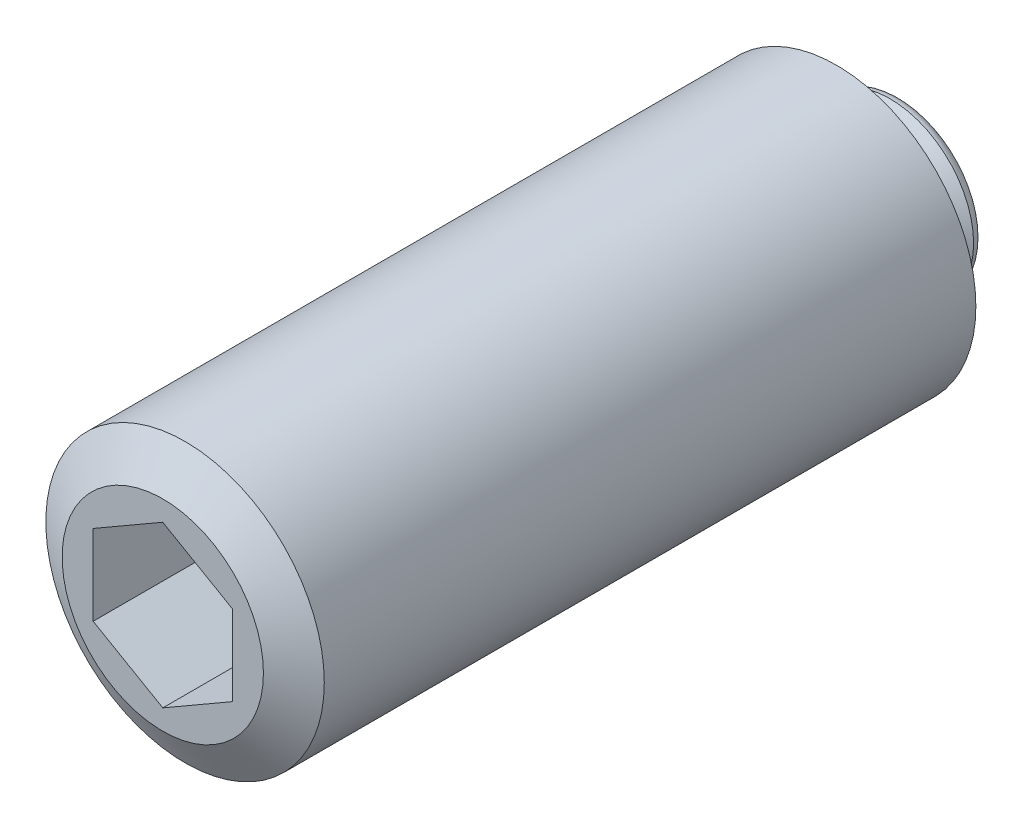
ISO-10303-21;
HEADER;
FILE_DESCRIPTION(('STEP AP214'),'2;1');
FILE_NAME('part.step','',(''),(''),'','','');
FILE_SCHEMA(('AUTOMOTIVE_DESIGN { 1 0 10303 214 1 1 1 1 }'));
ENDSEC;
DATA;
#1=APPLICATION_CONTEXT('core data for automotive mechanical design processes');
#2=APPLICATION_PROTOCOL_DEFINITION('international standard','automotive_design',2000,#1);
#3=PRODUCT_CONTEXT('',#1,'mechanical');
#4=PRODUCT('Part','Part','',(#3));
#5=PRODUCT_RELATED_PRODUCT_CATEGORY('part','',(#4));
#6=PRODUCT_DEFINITION_FORMATION('','',#4);
#7=PRODUCT_DEFINITION_CONTEXT('part definition',#1,'design');
#8=PRODUCT_DEFINITION('design','',#6,#7);
#9=PRODUCT_DEFINITION_SHAPE('','',#8);
#10=(LENGTH_UNIT() NAMED_UNIT(*) SI_UNIT(.MILLI.,.METRE.));
#11=(NAMED_UNIT(*) PLANE_ANGLE_UNIT() SI_UNIT($,.RADIAN.));
#12=(NAMED_UNIT(*) SI_UNIT($,.STERADIAN.) SOLID_ANGLE_UNIT());
#13=UNCERTAINTY_MEASURE_WITH_UNIT(LENGTH_MEASURE(1.E-05),#10,'distance_accuracy_value','');
#14=(GEOMETRIC_REPRESENTATION_CONTEXT(3) GLOBAL_UNCERTAINTY_ASSIGNED_CONTEXT((#13)) GLOBAL_UNIT_ASSIGNED_CONTEXT((#10,
#11,#12)) REPRESENTATION_CONTEXT('',''));
#15=CARTESIAN_POINT('',(0.,0.,0.));
#16=DIRECTION('',(0.,0.,1.));
#17=DIRECTION('',(1.,0.,0.));
#18=AXIS2_PLACEMENT_3D('',#15,#16,#17);
#19=CARTESIAN_POINT('',(0.,3.61435950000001,26.5));
#20=DIRECTION('',(0.,0.,1.));
#21=DIRECTION('',(1.,0.,0.));
#22=AXIS2_PLACEMENT_3D('',#19,#20,#21);
#23=PLANE('',#22);
#24=DIRECTION('',(-0.866025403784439,0.5,0.));
#25=VECTOR('',#24,1.);
#26=CARTESIAN_POINT('',(2.5,1.44337567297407,26.5));
#27=LINE('',#26,#25);
#28=CARTESIAN_POINT('',(2.5,1.44337567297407,26.5));
#29=VERTEX_POINT('',#28);
#30=CARTESIAN_POINT('',(0.,2.88675134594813,26.5));
#31=VERTEX_POINT('',#30);
#32=EDGE_CURVE('E28',#29,#31,#27,.T.);
#33=ORIENTED_EDGE('',*,*,#32,.F.);
#34=DIRECTION('',(0.,1.,0.));
#35=VECTOR('',#34,1.);
#36=CARTESIAN_POINT('',(2.5,-1.44337567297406,26.5));
#37=LINE('',#36,#35);
#38=CARTESIAN_POINT('',(2.5,-1.44337567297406,26.5));
#39=VERTEX_POINT('',#38);
#40=EDGE_CURVE('E111',#39,#29,#37,.T.);
#41=ORIENTED_EDGE('',*,*,#40,.F.);
#42=DIRECTION('',(0.866025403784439,0.5,0.));
#43=VECTOR('',#42,1.);
#44=CARTESIAN_POINT('',(0.,-2.88675134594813,26.5));
#45=LINE('',#44,#43);
#46=CARTESIAN_POINT('',(0.,-2.88675134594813,26.5));
#47=VERTEX_POINT('',#46);
#48=EDGE_CURVE('E109',#47,#39,#45,.T.);
#49=ORIENTED_EDGE('',*,*,#48,.F.);
#50=DIRECTION('',(0.866025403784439,-0.5,0.));
#51=VECTOR('',#50,1.);
#52=CARTESIAN_POINT('',(-2.5,-1.44337567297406,26.5));
#53=LINE('',#52,#51);
#54=CARTESIAN_POINT('',(-2.5,-1.44337567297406,26.5));
#55=VERTEX_POINT('',#54);
#56=EDGE_CURVE('E76',#55,#47,#53,.T.);
#57=ORIENTED_EDGE('',*,*,#56,.F.);
#58=DIRECTION('',(0.,-1.,0.));
#59=VECTOR('',#58,1.);
#60=CARTESIAN_POINT('',(-2.5,1.44337567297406,26.5));
#61=LINE('',#60,#59);
#62=CARTESIAN_POINT('',(-2.5,1.44337567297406,26.5));
#63=VERTEX_POINT('',#62);
#64=EDGE_CURVE('E105',#63,#55,#61,.T.);
#65=ORIENTED_EDGE('',*,*,#64,.F.);
#66=DIRECTION('',(-0.866025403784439,-0.5,0.));
#67=VECTOR('',#66,1.);
#68=CARTESIAN_POINT('',(0.,2.88675134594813,26.5));
#69=LINE('',#68,#67);
#70=EDGE_CURVE('E102',#31,#63,#69,.T.);
#71=ORIENTED_EDGE('',*,*,#70,.F.);
#72=EDGE_LOOP('',(#33,#41,#49,#57,#65,#71));
#73=FACE_BOUND('',#72,.T.);
#74=CARTESIAN_POINT('',(0.,0.,26.5));
#75=DIRECTION('',(0.,0.,1.));
#76=DIRECTION('',(1.,0.,0.));
#77=AXIS2_PLACEMENT_3D('',#74,#75,#76);
#78=CIRCLE('',#77,3.61435950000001);
#79=CARTESIAN_POINT('',(3.61435950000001,0.,26.5));
#80=VERTEX_POINT('',#79);
#81=EDGE_CURVE('E9',#80,#80,#78,.T.);
#82=ORIENTED_EDGE('',*,*,#81,.T.);
#83=EDGE_LOOP('',(#82));
#84=FACE_BOUND('',#83,.T.);
#85=ADVANCED_FACE('F14',(#73,#84),#23,.T.);
#86=CARTESIAN_POINT('',(0.,0.,26.5));
#87=DIRECTION('',(0.,0.,-1.));
#88=DIRECTION('',(-1.,0.,0.));
#89=AXIS2_PLACEMENT_3D('',#86,#87,#88);
#90=CONICAL_SURFACE('',#89,3.61435950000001,1.0471973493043);
#91=CARTESIAN_POINT('',(0.,0.,25.7));
#92=DIRECTION('',(0.,0.,1.));
#93=DIRECTION('',(1.,0.,0.));
#94=AXIS2_PLACEMENT_3D('',#91,#92,#93);
#95=CIRCLE('',#94,4.9999995);
#96=CARTESIAN_POINT('',(4.9999995,0.,25.7));
#97=VERTEX_POINT('',#96);
#98=EDGE_CURVE('E21',#97,#97,#95,.T.);
#99=ORIENTED_EDGE('',*,*,#98,.T.);
#100=EDGE_LOOP('',(#99));
#101=FACE_BOUND('',#100,.T.);
#102=ORIENTED_EDGE('',*,*,#81,.F.);
#103=EDGE_LOOP('',(#102));
#104=FACE_BOUND('',#103,.T.);
#105=ADVANCED_FACE('F143',(#101,#104),#90,.T.);
#106=CARTESIAN_POINT('',(0.,0.,29.5));
#107=DIRECTION('',(0.,0.,1.));
#108=DIRECTION('',(1.,0.,0.));
#109=AXIS2_PLACEMENT_3D('',#106,#107,#108);
#110=CYLINDRICAL_SURFACE('',#109,4.9999995);
#111=CARTESIAN_POINT('',(0.,0.,2.3));
#112=DIRECTION('',(0.,0.,1.));
#113=DIRECTION('',(1.,0.,0.));
#114=AXIS2_PLACEMENT_3D('',#111,#112,#113);
#115=CIRCLE('',#114,4.9999995);
#116=CARTESIAN_POINT('',(4.9999995,0.,2.3));
#117=VERTEX_POINT('',#116);
#118=EDGE_CURVE('E138',#117,#117,#115,.T.);
#119=ORIENTED_EDGE('',*,*,#118,.T.);
#120=EDGE_LOOP('',(#119));
#121=FACE_BOUND('',#120,.T.);
#122=ORIENTED_EDGE('',*,*,#98,.F.);
#123=EDGE_LOOP('',(#122));
#124=FACE_BOUND('',#123,.T.);
#125=ADVANCED_FACE('F146',(#121,#124),#110,.T.);
#126=CARTESIAN_POINT('',(0.,0.,2.3));
#127=DIRECTION('',(0.,0.,1.));
#128=DIRECTION('',(1.,0.,0.));
#129=AXIS2_PLACEMENT_3D('',#126,#127,#128);
#130=CONICAL_SURFACE('',#129,4.9999995,1.0471973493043);
#131=CARTESIAN_POINT('',(0.,0.,1.5));
#132=DIRECTION('',(0.,0.,1.));
#133=DIRECTION('',(1.,0.,0.));
#134=AXIS2_PLACEMENT_3D('',#131,#132,#133);
#135=CIRCLE('',#134,3.61435950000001);
#136=CARTESIAN_POINT('',(3.61435950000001,0.,1.5));
#137=VERTEX_POINT('',#136);
#138=EDGE_CURVE('E135',#137,#137,#135,.T.);
#139=ORIENTED_EDGE('',*,*,#138,.T.);
#140=EDGE_LOOP('',(#139));
#141=FACE_BOUND('',#140,.T.);
#142=ORIENTED_EDGE('',*,*,#118,.F.);
#143=EDGE_LOOP('',(#142));
#144=FACE_BOUND('',#143,.T.);
#145=ADVANCED_FACE('F148',(#141,#144),#130,.T.);
#146=CARTESIAN_POINT('',(0.,3.61435950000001,1.5));
#147=DIRECTION('',(0.,0.,-1.));
#148=DIRECTION('',(-1.,0.,0.));
#149=AXIS2_PLACEMENT_3D('',#146,#147,#148);
#150=PLANE('',#149);
#151=CARTESIAN_POINT('',(0.,0.,1.5));
#152=DIRECTION('',(0.,0.,1.));
#153=DIRECTION('',(1.,0.,0.));
#154=AXIS2_PLACEMENT_3D('',#151,#152,#153);
#155=CIRCLE('',#154,2.);
#156=CARTESIAN_POINT('',(2.,0.,1.5));
#157=VERTEX_POINT('',#156);
#158=EDGE_CURVE('E132',#157,#157,#155,.T.);
#159=ORIENTED_EDGE('',*,*,#158,.T.);
#160=EDGE_LOOP('',(#159));
#161=FACE_BOUND('',#160,.T.);
#162=ORIENTED_EDGE('',*,*,#138,.F.);
#163=EDGE_LOOP('',(#162));
#164=FACE_BOUND('',#163,.T.);
#165=ADVANCED_FACE('F157',(#161,#164),#150,.T.);
#166=CARTESIAN_POINT('',(0.,0.,29.5));
#167=DIRECTION('',(0.,0.,1.));
#168=DIRECTION('',(1.,0.,0.));
#169=AXIS2_PLACEMENT_3D('',#166,#167,#168);
#170=CYLINDRICAL_SURFACE('',#169,2.);
#171=CARTESIAN_POINT('',(0.,0.,1.2134315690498));
#172=DIRECTION('',(0.,0.,1.));
#173=DIRECTION('',(1.,0.,0.));
#174=AXIS2_PLACEMENT_3D('',#171,#172,#173);
#175=CIRCLE('',#174,2.);
#176=CARTESIAN_POINT('',(2.,0.,1.2134315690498));
#177=VERTEX_POINT('',#176);
#178=EDGE_CURVE('E129',#177,#177,#175,.T.);
#179=ORIENTED_EDGE('',*,*,#178,.T.);
#180=EDGE_LOOP('',(#179));
#181=FACE_BOUND('',#180,.T.);
#182=ORIENTED_EDGE('',*,*,#158,.F.);
#183=EDGE_LOOP('',(#182));
#184=FACE_BOUND('',#183,.T.);
#185=ADVANCED_FACE('F200',(#181,#184),#170,.T.);
#186=CARTESIAN_POINT('',(0.,0.,1.2134315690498));
#187=DIRECTION('',(0.,0.,1.));
#188=DIRECTION('',(1.,0.,0.));
#189=AXIS2_PLACEMENT_3D('',#186,#187,#188);
#190=TOROIDAL_SURFACE('',#189,2.254,0.254000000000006);
#191=CARTESIAN_POINT('',(0.,0.,1.0053669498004));
#192=DIRECTION('',(0.,0.,1.));
#193=DIRECTION('',(1.,0.,0.));
#194=AXIS2_PLACEMENT_3D('',#191,#192,#193);
#195=CIRCLE('',#194,2.10831158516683);
#196=CARTESIAN_POINT('',(2.10831158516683,0.,1.0053669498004));
#197=VERTEX_POINT('',#196);
#198=EDGE_CURVE('E126',#197,#197,#195,.T.);
#199=ORIENTED_EDGE('',*,*,#198,.T.);
#200=EDGE_LOOP('',(#199));
#201=FACE_BOUND('',#200,.T.);
#202=ORIENTED_EDGE('',*,*,#178,.F.);
#203=EDGE_LOOP('',(#202));
#204=FACE_BOUND('',#203,.T.);
#205=ADVANCED_FACE('F196',(#201,#204),#190,.F.);
#206=CARTESIAN_POINT('',(0.,0.,1.0053669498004));
#207=DIRECTION('',(0.,0.,-1.));
#208=DIRECTION('',(-1.,0.,0.));
#209=AXIS2_PLACEMENT_3D('',#206,#207,#208);
#210=CONICAL_SURFACE('',#209,2.10831158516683,0.959931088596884);
#211=CARTESIAN_POINT('',(0.,0.,0.381));
#212=DIRECTION('',(0.,0.,1.));
#213=DIRECTION('',(1.,0.,0.));
#214=AXIS2_PLACEMENT_3D('',#211,#212,#213);
#215=CIRCLE('',#214,3.);
#216=CARTESIAN_POINT('',(3.,0.,0.381));
#217=VERTEX_POINT('',#216);
#218=EDGE_CURVE('E123',#217,#217,#215,.T.);
#219=ORIENTED_EDGE('',*,*,#218,.T.);
#220=EDGE_LOOP('',(#219));
#221=FACE_BOUND('',#220,.T.);
#222=ORIENTED_EDGE('',*,*,#198,.F.);
#223=EDGE_LOOP('',(#222));
#224=FACE_BOUND('',#223,.T.);
#225=ADVANCED_FACE('F192',(#221,#224),#210,.T.);
#226=CARTESIAN_POINT('',(0.,0.,0.381));
#227=DIRECTION('',(0.,0.,1.));
#228=DIRECTION('',(1.,0.,0.));
#229=AXIS2_PLACEMENT_3D('',#226,#227,#228);
#230=TOROIDAL_SURFACE('',#229,2.619,0.381);
#231=CARTESIAN_POINT('',(0.,0.,0.));
#232=DIRECTION('',(0.,0.,1.));
#233=DIRECTION('',(1.,0.,0.));
#234=AXIS2_PLACEMENT_3D('',#231,#232,#233);
#235=CIRCLE('',#234,2.619);
#236=CARTESIAN_POINT('',(2.619,0.,0.));
#237=VERTEX_POINT('',#236);
#238=EDGE_CURVE('E115',#237,#237,#235,.T.);
#239=ORIENTED_EDGE('',*,*,#238,.T.);
#240=EDGE_LOOP('',(#239));
#241=FACE_BOUND('',#240,.T.);
#242=ORIENTED_EDGE('',*,*,#218,.F.);
#243=EDGE_LOOP('',(#242));
#244=FACE_BOUND('',#243,.T.);
#245=ADVANCED_FACE('F184',(#241,#244),#230,.T.);
#246=CARTESIAN_POINT('',(0.,0.,0.));
#247=DIRECTION('',(0.,0.,-1.));
#248=DIRECTION('',(-1.,0.,0.));
#249=AXIS2_PLACEMENT_3D('',#246,#247,#248);
#250=PLANE('',#249);
#251=ORIENTED_EDGE('',*,*,#238,.F.);
#252=EDGE_LOOP('',(#251));
#253=FACE_BOUND('',#252,.T.);
#254=ADVANCED_FACE('F176',(#253),#250,.T.);
#255=CARTESIAN_POINT('',(2.5,1.44337567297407,22.5));
#256=DIRECTION('',(0.5,0.866025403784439,0.));
#257=DIRECTION('',(0.866025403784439,-0.5,0.));
#258=AXIS2_PLACEMENT_3D('',#255,#256,#257);
#259=PLANE('',#258);
#260=ORIENTED_EDGE('',*,*,#32,.T.);
#261=DIRECTION('',(0.,0.,1.));
#262=VECTOR('',#261,1.);
#263=CARTESIAN_POINT('',(0.,2.88675134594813,22.5));
#264=LINE('',#263,#262);
#265=CARTESIAN_POINT('',(0.,2.88675134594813,22.5));
#266=VERTEX_POINT('',#265);
#267=EDGE_CURVE('E58',#266,#31,#264,.T.);
#268=ORIENTED_EDGE('',*,*,#267,.F.);
#269=DIRECTION('',(-0.866025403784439,0.5,0.));
#270=VECTOR('',#269,1.);
#271=CARTESIAN_POINT('',(2.5,1.44337567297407,22.5));
#272=LINE('',#271,#270);
#273=CARTESIAN_POINT('',(2.5,1.44337567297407,22.5));
#274=VERTEX_POINT('',#273);
#275=EDGE_CURVE('E113',#274,#266,#272,.T.);
#276=ORIENTED_EDGE('',*,*,#275,.F.);
#277=DIRECTION('',(0.,0.,1.));
#278=VECTOR('',#277,1.);
#279=CARTESIAN_POINT('',(2.5,1.44337567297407,22.5));
#280=LINE('',#279,#278);
#281=EDGE_CURVE('E36',#274,#29,#280,.T.);
#282=ORIENTED_EDGE('',*,*,#281,.T.);
#283=EDGE_LOOP('',(#260,#268,#276,#282));
#284=FACE_BOUND('',#283,.T.);
#285=ADVANCED_FACE('F173',(#284),#259,.F.);
#286=CARTESIAN_POINT('',(2.5,-1.44337567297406,22.5));
#287=DIRECTION('',(1.,0.,0.));
#288=DIRECTION('',(0.,0.,-1.));
#289=AXIS2_PLACEMENT_3D('',#286,#287,#288);
#290=PLANE('',#289);
#291=ORIENTED_EDGE('',*,*,#40,.T.);
#292=ORIENTED_EDGE('',*,*,#281,.F.);
#293=DIRECTION('',(0.,1.,0.));
#294=VECTOR('',#293,1.);
#295=CARTESIAN_POINT('',(2.5,-1.44337567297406,22.5));
#296=LINE('',#295,#294);
#297=CARTESIAN_POINT('',(2.5,-1.44337567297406,22.5));
#298=VERTEX_POINT('',#297);
#299=EDGE_CURVE('E88',#298,#274,#296,.T.);
#300=ORIENTED_EDGE('',*,*,#299,.F.);
#301=DIRECTION('',(0.,0.,1.));
#302=VECTOR('',#301,1.);
#303=CARTESIAN_POINT('',(2.5,-1.44337567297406,22.5));
#304=LINE('',#303,#302);
#305=EDGE_CURVE('E80',#298,#39,#304,.T.);
#306=ORIENTED_EDGE('',*,*,#305,.T.);
#307=EDGE_LOOP('',(#291,#292,#300,#306));
#308=FACE_BOUND('',#307,.T.);
#309=ADVANCED_FACE('F175',(#308),#290,.F.);
#310=CARTESIAN_POINT('',(0.,-2.88675134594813,22.5));
#311=DIRECTION('',(0.5,-0.866025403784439,0.));
#312=DIRECTION('',(-0.866025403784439,-0.5,0.));
#313=AXIS2_PLACEMENT_3D('',#310,#311,#312);
#314=PLANE('',#313);
#315=ORIENTED_EDGE('',*,*,#48,.T.);
#316=ORIENTED_EDGE('',*,*,#305,.F.);
#317=DIRECTION('',(0.866025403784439,0.5,0.));
#318=VECTOR('',#317,1.);
#319=CARTESIAN_POINT('',(0.,-2.88675134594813,22.5));
#320=LINE('',#319,#318);
#321=CARTESIAN_POINT('',(0.,-2.88675134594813,22.5));
#322=VERTEX_POINT('',#321);
#323=EDGE_CURVE('E84',#322,#298,#320,.T.);
#324=ORIENTED_EDGE('',*,*,#323,.F.);
#325=DIRECTION('',(0.,0.,1.));
#326=VECTOR('',#325,1.);
#327=CARTESIAN_POINT('',(0.,-2.88675134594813,22.5));
#328=LINE('',#327,#326);
#329=EDGE_CURVE('E69',#322,#47,#328,.T.);
#330=ORIENTED_EDGE('',*,*,#329,.T.);
#331=EDGE_LOOP('',(#315,#316,#324,#330));
#332=FACE_BOUND('',#331,.T.);
#333=ADVANCED_FACE('F85',(#332),#314,.F.);
#334=CARTESIAN_POINT('',(-2.5,-1.44337567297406,22.5));
#335=DIRECTION('',(-0.5,-0.866025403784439,0.));
#336=DIRECTION('',(-0.866025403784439,0.5,0.));
#337=AXIS2_PLACEMENT_3D('',#334,#335,#336);
#338=PLANE('',#337);
#339=ORIENTED_EDGE('',*,*,#56,.T.);
#340=ORIENTED_EDGE('',*,*,#329,.F.);
#341=DIRECTION('',(0.866025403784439,-0.5,0.));
#342=VECTOR('',#341,1.);
#343=CARTESIAN_POINT('',(-2.5,-1.44337567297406,22.5));
#344=LINE('',#343,#342);
#345=CARTESIAN_POINT('',(-2.5,-1.44337567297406,22.5));
#346=VERTEX_POINT('',#345);
#347=EDGE_CURVE('E73',#346,#322,#344,.T.);
#348=ORIENTED_EDGE('',*,*,#347,.F.);
#349=DIRECTION('',(0.,0.,1.));
#350=VECTOR('',#349,1.);
#351=CARTESIAN_POINT('',(-2.5,-1.44337567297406,22.5));
#352=LINE('',#351,#350);
#353=EDGE_CURVE('E81',#346,#55,#352,.T.);
#354=ORIENTED_EDGE('',*,*,#353,.T.);
#355=EDGE_LOOP('',(#339,#340,#348,#354));
#356=FACE_BOUND('',#355,.T.);
#357=ADVANCED_FACE('F71',(#356),#338,.F.);
#358=CARTESIAN_POINT('',(-2.5,1.44337567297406,22.5));
#359=DIRECTION('',(-1.,0.,0.));
#360=DIRECTION('',(0.,1.,0.));
#361=AXIS2_PLACEMENT_3D('',#358,#359,#360);
#362=PLANE('',#361);
#363=ORIENTED_EDGE('',*,*,#64,.T.);
#364=ORIENTED_EDGE('',*,*,#353,.F.);
#365=DIRECTION('',(0.,-1.,0.));
#366=VECTOR('',#365,1.);
#367=CARTESIAN_POINT('',(-2.5,1.44337567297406,22.5));
#368=LINE('',#367,#366);
#369=CARTESIAN_POINT('',(-2.5,1.44337567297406,22.5));
#370=VERTEX_POINT('',#369);
#371=EDGE_CURVE('E94',#370,#346,#368,.T.);
#372=ORIENTED_EDGE('',*,*,#371,.F.);
#373=DIRECTION('',(0.,0.,1.));
#374=VECTOR('',#373,1.);
#375=CARTESIAN_POINT('',(-2.5,1.44337567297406,22.5));
#376=LINE('',#375,#374);
#377=EDGE_CURVE('E118',#370,#63,#376,.T.);
#378=ORIENTED_EDGE('',*,*,#377,.T.);
#379=EDGE_LOOP('',(#363,#364,#372,#378));
#380=FACE_BOUND('',#379,.T.);
#381=ADVANCED_FACE('F295',(#380),#362,.F.);
#382=CARTESIAN_POINT('',(0.,2.88675134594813,22.5));
#383=DIRECTION('',(-0.5,0.866025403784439,0.));
#384=DIRECTION('',(0.866025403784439,0.5,0.));
#385=AXIS2_PLACEMENT_3D('',#382,#383,#384);
#386=PLANE('',#385);
#387=ORIENTED_EDGE('',*,*,#70,.T.);
#388=ORIENTED_EDGE('',*,*,#377,.F.);
#389=DIRECTION('',(-0.866025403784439,-0.5,0.));
#390=VECTOR('',#389,1.);
#391=CARTESIAN_POINT('',(0.,2.88675134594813,22.5));
#392=LINE('',#391,#390);
#393=EDGE_CURVE('E96',#266,#370,#392,.T.);
#394=ORIENTED_EDGE('',*,*,#393,.F.);
#395=ORIENTED_EDGE('',*,*,#267,.T.);
#396=EDGE_LOOP('',(#387,#388,#394,#395));
#397=FACE_BOUND('',#396,.T.);
#398=ADVANCED_FACE('F171',(#397),#386,.F.);
#399=CARTESIAN_POINT('',(0.,2.88675134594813,22.5));
#400=DIRECTION('',(0.,0.,1.));
#401=DIRECTION('',(1.,0.,0.));
#402=AXIS2_PLACEMENT_3D('',#399,#400,#401);
#403=PLANE('',#402);
#404=ORIENTED_EDGE('',*,*,#275,.T.);
#405=ORIENTED_EDGE('',*,*,#393,.T.);
#406=ORIENTED_EDGE('',*,*,#371,.T.);
#407=ORIENTED_EDGE('',*,*,#347,.T.);
#408=ORIENTED_EDGE('',*,*,#323,.T.);
#409=ORIENTED_EDGE('',*,*,#299,.T.);
#410=EDGE_LOOP('',(#404,#405,#406,#407,#408,#409));
#411=FACE_BOUND('',#410,.T.);
#412=ADVANCED_FACE('F91',(#411),#403,.T.);
#413=CLOSED_SHELL('',(#85,#105,#125,#145,#165,#185,#205,#225,#245,#254,#285,#309,#333,#357,#381,
#398,#412));
#414=MANIFOLD_SOLID_BREP('B1',#413);
#415=ADVANCED_BREP_SHAPE_REPRESENTATION('',(#18,#414),#14);
#416=SHAPE_DEFINITION_REPRESENTATION(#9,#415);
ENDSEC;
END-ISO-10303-21;
